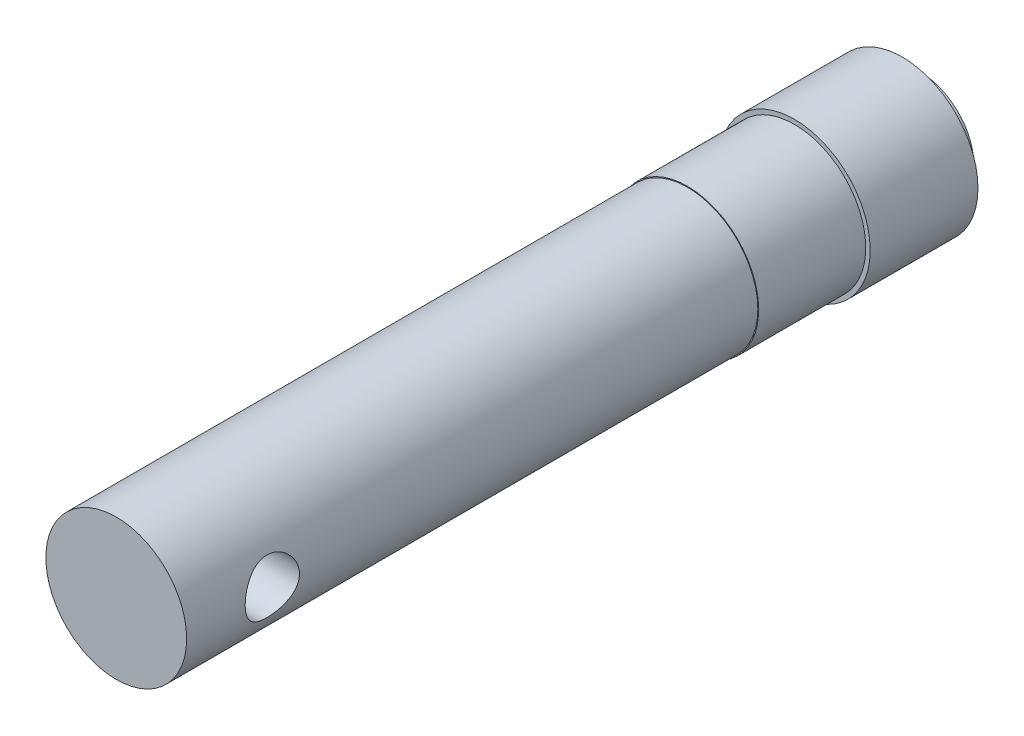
from build123d import *

# Parameters (mm, degrees)
SKETCH1_R          = 13.462
EXTRUDE1_DEPTH     = 9.5885
SKETCH3_R          = 9.5631
EXTRUDE3_DEPTH     = 3.175
SKETCH4_R          = 12.6746
EXTRUDE4_DEPTH     = 19.05
SKETCH5_R          = 12.5222
EXTRUDE5_DEPTH     = 101.6
SKETCH7_R          = 4.826
CUT_EXTRUDE2_DEPTH = 134.520569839


with BuildPart() as part:
    # Sketch1 → Extrude1 (new, symmetric)
    with BuildSketch(Plane.XY):
        Circle(SKETCH1_R)
    extrude(amount=EXTRUDE1_DEPTH, both=True)

    # Sketch3 → Extrude3 (add)
    with BuildSketch(Plane(origin=(0, 0, -9.5885), x_dir=(-1, 0, 0), z_dir=(0, 0, -1))):
        with Locations(Location((0, 0, 0), (0, 0, 180))):
            Circle(SKETCH3_R)
    extrude(amount=EXTRUDE3_DEPTH)

    # Sketch4 → Extrude4 (add)
    with BuildSketch(Plane.XY.offset(9.5885)):
        with Locations(Location((0, 0, 0), (0, 0, 180))):
            Circle(SKETCH4_R)
    extrude(amount=EXTRUDE4_DEPTH)

    # Sketch5 → Extrude5 (add)
    with BuildSketch(Plane.XY.offset(28.6385)):
        Circle(SKETCH5_R)
    extrude(amount=EXTRUDE5_DEPTH)

    # Sketch7 → Cut-Extrude2 (cut, through all)
    with BuildSketch(Plane(origin=(12.7, 0, 0), x_dir=(0, 0, -1), z_dir=(1, 0, 0))):
        with Locations(Location((-114.9985, 0, 0), (0, 0, 180.000000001))):
            Circle(SKETCH7_R)
    extrude(amount=-CUT_EXTRUDE2_DEPTH, mode=Mode.SUBTRACT)


solid = part.part
